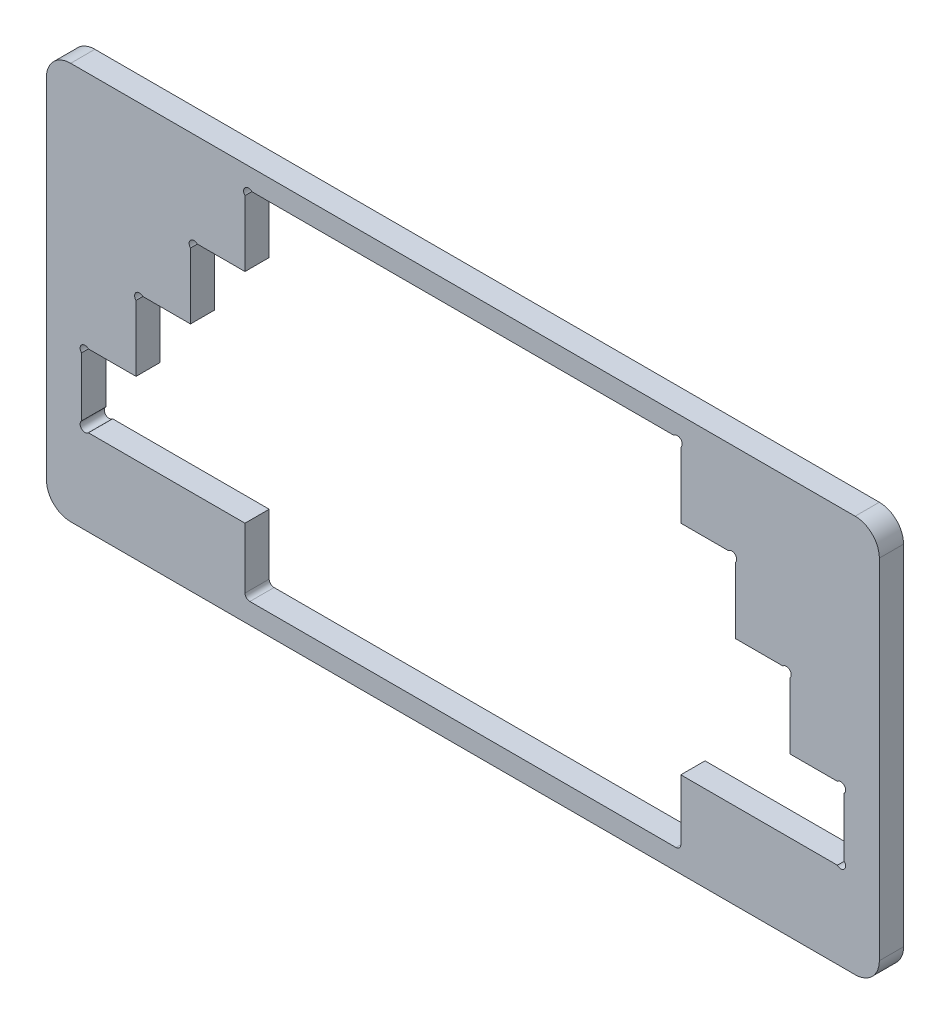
ISO-10303-21;
HEADER;
FILE_DESCRIPTION(('STEP AP214'),'2;1');
FILE_NAME('part.step','',(''),(''),'','','');
FILE_SCHEMA(('AUTOMOTIVE_DESIGN { 1 0 10303 214 1 1 1 1 }'));
ENDSEC;
DATA;
#1=APPLICATION_CONTEXT('core data for automotive mechanical design processes');
#2=APPLICATION_PROTOCOL_DEFINITION('international standard','automotive_design',2000,#1);
#3=PRODUCT_CONTEXT('',#1,'mechanical');
#4=PRODUCT('Part','Part','',(#3));
#5=PRODUCT_RELATED_PRODUCT_CATEGORY('part','',(#4));
#6=PRODUCT_DEFINITION_FORMATION('','',#4);
#7=PRODUCT_DEFINITION_CONTEXT('part definition',#1,'design');
#8=PRODUCT_DEFINITION('design','',#6,#7);
#9=PRODUCT_DEFINITION_SHAPE('','',#8);
#10=(LENGTH_UNIT() NAMED_UNIT(*) SI_UNIT(.MILLI.,.METRE.));
#11=(NAMED_UNIT(*) PLANE_ANGLE_UNIT() SI_UNIT($,.RADIAN.));
#12=(NAMED_UNIT(*) SI_UNIT($,.STERADIAN.) SOLID_ANGLE_UNIT());
#13=UNCERTAINTY_MEASURE_WITH_UNIT(LENGTH_MEASURE(1.E-05),#10,'distance_accuracy_value','');
#14=(GEOMETRIC_REPRESENTATION_CONTEXT(3) GLOBAL_UNCERTAINTY_ASSIGNED_CONTEXT((#13)) GLOBAL_UNIT_ASSIGNED_CONTEXT((#10,
#11,#12)) REPRESENTATION_CONTEXT('',''));
#15=CARTESIAN_POINT('',(0.,0.,0.));
#16=DIRECTION('',(0.,0.,1.));
#17=DIRECTION('',(1.,0.,0.));
#18=AXIS2_PLACEMENT_3D('',#15,#16,#17);
#19=CARTESIAN_POINT('',(162.,-25.5,10.));
#20=DIRECTION('',(0.,0.,-1.));
#21=DIRECTION('',(-1.,0.,0.));
#22=AXIS2_PLACEMENT_3D('',#19,#20,#21);
#23=PLANE('',#22);
#24=CARTESIAN_POINT('',(162.,-25.5,10.));
#25=DIRECTION('',(0.,0.,1.));
#26=DIRECTION('',(-1.,0.,0.));
#27=AXIS2_PLACEMENT_3D('',#24,#25,#26);
#28=CIRCLE('',#27,10.);
#29=CARTESIAN_POINT('',(162.,-35.5,10.));
#30=VERTEX_POINT('',#29);
#31=CARTESIAN_POINT('',(172.,-25.4999999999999,10.));
#32=VERTEX_POINT('',#31);
#33=EDGE_CURVE('E531',#30,#32,#28,.T.);
#34=ORIENTED_EDGE('',*,*,#33,.T.);
#35=DIRECTION('',(0.,1.,0.));
#36=VECTOR('',#35,1.);
#37=CARTESIAN_POINT('',(172.,118.5,10.));
#38=LINE('',#37,#36);
#39=CARTESIAN_POINT('',(172.,118.5,10.));
#40=VERTEX_POINT('',#39);
#41=EDGE_CURVE('E534',#32,#40,#38,.T.);
#42=ORIENTED_EDGE('',*,*,#41,.T.);
#43=CARTESIAN_POINT('',(162.,118.5,10.));
#44=DIRECTION('',(0.,0.,1.));
#45=DIRECTION('',(1.,0.,0.));
#46=AXIS2_PLACEMENT_3D('',#43,#44,#45);
#47=CIRCLE('',#46,10.);
#48=CARTESIAN_POINT('',(162.,128.5,10.));
#49=VERTEX_POINT('',#48);
#50=EDGE_CURVE('E536',#40,#49,#47,.T.);
#51=ORIENTED_EDGE('',*,*,#50,.T.);
#52=DIRECTION('',(-1.,0.,0.));
#53=VECTOR('',#52,1.);
#54=CARTESIAN_POINT('',(-162.,128.5,10.));
#55=LINE('',#54,#53);
#56=CARTESIAN_POINT('',(-162.,128.5,10.));
#57=VERTEX_POINT('',#56);
#58=EDGE_CURVE('E538',#49,#57,#55,.T.);
#59=ORIENTED_EDGE('',*,*,#58,.T.);
#60=CARTESIAN_POINT('',(-162.,118.5,10.));
#61=DIRECTION('',(0.,0.,1.));
#62=DIRECTION('',(-1.,0.,0.));
#63=AXIS2_PLACEMENT_3D('',#60,#61,#62);
#64=CIRCLE('',#63,10.);
#65=CARTESIAN_POINT('',(-172.,118.5,10.));
#66=VERTEX_POINT('',#65);
#67=EDGE_CURVE('E540',#57,#66,#64,.T.);
#68=ORIENTED_EDGE('',*,*,#67,.T.);
#69=DIRECTION('',(0.,-1.,0.));
#70=VECTOR('',#69,1.);
#71=CARTESIAN_POINT('',(-172.,118.5,10.));
#72=LINE('',#71,#70);
#73=CARTESIAN_POINT('',(-172.,-25.4999999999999,10.));
#74=VERTEX_POINT('',#73);
#75=EDGE_CURVE('E542',#66,#74,#72,.T.);
#76=ORIENTED_EDGE('',*,*,#75,.T.);
#77=CARTESIAN_POINT('',(-162.,-25.5,10.));
#78=DIRECTION('',(0.,0.,1.));
#79=DIRECTION('',(1.,0.,0.));
#80=AXIS2_PLACEMENT_3D('',#77,#78,#79);
#81=CIRCLE('',#80,10.);
#82=CARTESIAN_POINT('',(-162.,-35.5,10.));
#83=VERTEX_POINT('',#82);
#84=EDGE_CURVE('E544',#74,#83,#81,.T.);
#85=ORIENTED_EDGE('',*,*,#84,.T.);
#86=DIRECTION('',(1.,0.,0.));
#87=VECTOR('',#86,1.);
#88=CARTESIAN_POINT('',(162.,-35.5,10.));
#89=LINE('',#88,#87);
#90=EDGE_CURVE('E546',#83,#30,#89,.T.);
#91=ORIENTED_EDGE('',*,*,#90,.T.);
#92=EDGE_LOOP('',(#34,#42,#51,#59,#68,#76,#85,#91));
#93=FACE_BOUND('',#92,.T.);
#94=DIRECTION('',(0.,1.,0.));
#95=VECTOR('',#94,1.);
#96=CARTESIAN_POINT('',(90.,0.,10.));
#97=LINE('',#96,#95);
#98=CARTESIAN_POINT('',(90.0000000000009,-24.9999999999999,10.));
#99=VERTEX_POINT('',#98);
#100=CARTESIAN_POINT('',(90.,0.,10.));
#101=VERTEX_POINT('',#100);
#102=EDGE_CURVE('E298',#99,#101,#97,.T.);
#103=ORIENTED_EDGE('',*,*,#102,.F.);
#104=CARTESIAN_POINT('',(88.0000000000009,-25.,10.));
#105=DIRECTION('',(0.,0.,1.));
#106=DIRECTION('',(-1.,0.,0.));
#107=AXIS2_PLACEMENT_3D('',#104,#105,#106);
#108=CIRCLE('',#107,2.);
#109=CARTESIAN_POINT('',(88.0000000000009,-27.,10.));
#110=VERTEX_POINT('',#109);
#111=EDGE_CURVE('E453',#110,#99,#108,.T.);
#112=ORIENTED_EDGE('',*,*,#111,.F.);
#113=DIRECTION('',(1.,0.,0.));
#114=VECTOR('',#113,1.);
#115=CARTESIAN_POINT('',(-88.0000000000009,-27.,10.));
#116=LINE('',#115,#114);
#117=CARTESIAN_POINT('',(-88.0000000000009,-27.,10.));
#118=VERTEX_POINT('',#117);
#119=EDGE_CURVE('E451',#118,#110,#116,.T.);
#120=ORIENTED_EDGE('',*,*,#119,.F.);
#121=CARTESIAN_POINT('',(-88.0000000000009,-25.,10.));
#122=DIRECTION('',(0.,0.,1.));
#123=DIRECTION('',(1.,0.,0.));
#124=AXIS2_PLACEMENT_3D('',#121,#122,#123);
#125=CIRCLE('',#124,2.);
#126=CARTESIAN_POINT('',(-90.0000000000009,-24.9999999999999,10.));
#127=VERTEX_POINT('',#126);
#128=EDGE_CURVE('E449',#127,#118,#125,.T.);
#129=ORIENTED_EDGE('',*,*,#128,.F.);
#130=DIRECTION('',(0.,-1.,0.));
#131=VECTOR('',#130,1.);
#132=CARTESIAN_POINT('',(-90.,0.,10.));
#133=LINE('',#132,#131);
#134=CARTESIAN_POINT('',(-90.,0.,10.));
#135=VERTEX_POINT('',#134);
#136=EDGE_CURVE('E447',#135,#127,#133,.T.);
#137=ORIENTED_EDGE('',*,*,#136,.F.);
#138=DIRECTION('',(1.,0.,0.));
#139=VECTOR('',#138,1.);
#140=CARTESIAN_POINT('',(-154.671572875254,0.,10.));
#141=LINE('',#140,#139);
#142=CARTESIAN_POINT('',(-154.671572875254,0.,10.));
#143=VERTEX_POINT('',#142);
#144=EDGE_CURVE('E445',#143,#135,#141,.T.);
#145=ORIENTED_EDGE('',*,*,#144,.F.);
#146=CARTESIAN_POINT('',(-156.085786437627,1.41421356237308,10.));
#147=DIRECTION('',(0.,0.,1.));
#148=DIRECTION('',(-1.,0.,0.));
#149=AXIS2_PLACEMENT_3D('',#146,#147,#148);
#150=CIRCLE('',#149,2.00000000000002);
#151=CARTESIAN_POINT('',(-157.5,2.82842712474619,10.));
#152=VERTEX_POINT('',#151);
#153=EDGE_CURVE('E443',#152,#143,#150,.T.);
#154=ORIENTED_EDGE('',*,*,#153,.F.);
#155=DIRECTION('',(0.,-1.,0.));
#156=VECTOR('',#155,1.);
#157=CARTESIAN_POINT('',(-157.5,27.1715728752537,10.));
#158=LINE('',#157,#156);
#159=CARTESIAN_POINT('',(-157.5,27.1715728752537,10.));
#160=VERTEX_POINT('',#159);
#161=EDGE_CURVE('E441',#160,#152,#158,.T.);
#162=ORIENTED_EDGE('',*,*,#161,.F.);
#163=CARTESIAN_POINT('',(-156.085786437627,28.5857864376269,10.));
#164=DIRECTION('',(0.,0.,1.));
#165=DIRECTION('',(1.,0.,0.));
#166=AXIS2_PLACEMENT_3D('',#163,#164,#165);
#167=CIRCLE('',#166,2.);
#168=CARTESIAN_POINT('',(-154.671572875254,30.,10.));
#169=VERTEX_POINT('',#168);
#170=EDGE_CURVE('E439',#169,#160,#167,.T.);
#171=ORIENTED_EDGE('',*,*,#170,.F.);
#172=DIRECTION('',(-1.,0.,0.));
#173=VECTOR('',#172,1.);
#174=CARTESIAN_POINT('',(-135.,30.,10.));
#175=LINE('',#174,#173);
#176=CARTESIAN_POINT('',(-135.,30.,10.));
#177=VERTEX_POINT('',#176);
#178=EDGE_CURVE('E437',#177,#169,#175,.T.);
#179=ORIENTED_EDGE('',*,*,#178,.F.);
#180=DIRECTION('',(0.,-1.,0.));
#181=VECTOR('',#180,1.);
#182=CARTESIAN_POINT('',(-135.,57.1715728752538,10.));
#183=LINE('',#182,#181);
#184=CARTESIAN_POINT('',(-135.,57.1715728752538,10.));
#185=VERTEX_POINT('',#184);
#186=EDGE_CURVE('E435',#185,#177,#183,.T.);
#187=ORIENTED_EDGE('',*,*,#186,.F.);
#188=CARTESIAN_POINT('',(-133.585786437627,58.5857864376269,10.));
#189=DIRECTION('',(0.,0.,1.));
#190=DIRECTION('',(-1.,0.,0.));
#191=AXIS2_PLACEMENT_3D('',#188,#189,#190);
#192=CIRCLE('',#191,2.00000000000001);
#193=CARTESIAN_POINT('',(-132.171572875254,60.,10.));
#194=VERTEX_POINT('',#193);
#195=EDGE_CURVE('E433',#194,#185,#192,.T.);
#196=ORIENTED_EDGE('',*,*,#195,.F.);
#197=DIRECTION('',(-1.,0.,0.));
#198=VECTOR('',#197,1.);
#199=CARTESIAN_POINT('',(-112.5,60.,10.));
#200=LINE('',#199,#198);
#201=CARTESIAN_POINT('',(-112.5,60.,10.));
#202=VERTEX_POINT('',#201);
#203=EDGE_CURVE('E431',#202,#194,#200,.T.);
#204=ORIENTED_EDGE('',*,*,#203,.F.);
#205=DIRECTION('',(0.,-1.,0.));
#206=VECTOR('',#205,1.);
#207=CARTESIAN_POINT('',(-112.5,87.1715728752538,10.));
#208=LINE('',#207,#206);
#209=CARTESIAN_POINT('',(-112.5,87.1715728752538,10.));
#210=VERTEX_POINT('',#209);
#211=EDGE_CURVE('E429',#210,#202,#208,.T.);
#212=ORIENTED_EDGE('',*,*,#211,.F.);
#213=CARTESIAN_POINT('',(-111.085786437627,88.5857864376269,10.));
#214=DIRECTION('',(0.,0.,1.));
#215=DIRECTION('',(-1.,0.,0.));
#216=AXIS2_PLACEMENT_3D('',#213,#214,#215);
#217=CIRCLE('',#216,2.00000000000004);
#218=CARTESIAN_POINT('',(-109.671572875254,90.,10.));
#219=VERTEX_POINT('',#218);
#220=EDGE_CURVE('E427',#219,#210,#217,.T.);
#221=ORIENTED_EDGE('',*,*,#220,.F.);
#222=DIRECTION('',(-1.,0.,0.));
#223=VECTOR('',#222,1.);
#224=CARTESIAN_POINT('',(-90.0000000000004,90.,10.));
#225=LINE('',#224,#223);
#226=CARTESIAN_POINT('',(-90.0000000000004,90.,10.));
#227=VERTEX_POINT('',#226);
#228=EDGE_CURVE('E425',#227,#219,#225,.T.);
#229=ORIENTED_EDGE('',*,*,#228,.F.);
#230=DIRECTION('',(0.,-1.,0.));
#231=VECTOR('',#230,1.);
#232=CARTESIAN_POINT('',(-90.0000000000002,117.171572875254,10.));
#233=LINE('',#232,#231);
#234=CARTESIAN_POINT('',(-90.0000000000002,117.171572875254,10.));
#235=VERTEX_POINT('',#234);
#236=EDGE_CURVE('E423',#235,#227,#233,.T.);
#237=ORIENTED_EDGE('',*,*,#236,.F.);
#238=CARTESIAN_POINT('',(-88.5857864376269,118.585786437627,10.));
#239=DIRECTION('',(0.,0.,1.));
#240=DIRECTION('',(-1.,0.,0.));
#241=AXIS2_PLACEMENT_3D('',#238,#239,#240);
#242=CIRCLE('',#241,2.00000000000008);
#243=CARTESIAN_POINT('',(-87.1715728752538,120.,10.));
#244=VERTEX_POINT('',#243);
#245=EDGE_CURVE('E421',#244,#235,#242,.T.);
#246=ORIENTED_EDGE('',*,*,#245,.F.);
#247=DIRECTION('',(-1.,0.,0.));
#248=VECTOR('',#247,1.);
#249=CARTESIAN_POINT('',(-87.1715728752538,120.,10.));
#250=LINE('',#249,#248);
#251=CARTESIAN_POINT('',(87.1715728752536,120.,10.));
#252=VERTEX_POINT('',#251);
#253=EDGE_CURVE('E419',#252,#244,#250,.T.);
#254=ORIENTED_EDGE('',*,*,#253,.F.);
#255=CARTESIAN_POINT('',(88.5857864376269,118.585786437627,10.));
#256=DIRECTION('',(0.,0.,1.));
#257=DIRECTION('',(1.,0.,0.));
#258=AXIS2_PLACEMENT_3D('',#255,#256,#257);
#259=CIRCLE('',#258,2.00000000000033);
#260=CARTESIAN_POINT('',(90.000000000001,117.171572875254,10.));
#261=VERTEX_POINT('',#260);
#262=EDGE_CURVE('E417',#261,#252,#259,.T.);
#263=ORIENTED_EDGE('',*,*,#262,.F.);
#264=DIRECTION('',(0.,1.,0.));
#265=VECTOR('',#264,1.);
#266=CARTESIAN_POINT('',(90.000000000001,117.171572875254,10.));
#267=LINE('',#266,#265);
#268=CARTESIAN_POINT('',(90.0000000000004,90.,10.));
#269=VERTEX_POINT('',#268);
#270=EDGE_CURVE('E415',#269,#261,#267,.T.);
#271=ORIENTED_EDGE('',*,*,#270,.F.);
#272=DIRECTION('',(-1.,0.,0.));
#273=VECTOR('',#272,1.);
#274=CARTESIAN_POINT('',(90.0000000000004,90.,10.));
#275=LINE('',#274,#273);
#276=CARTESIAN_POINT('',(109.671572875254,90.0000000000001,10.));
#277=VERTEX_POINT('',#276);
#278=EDGE_CURVE('E413',#277,#269,#275,.T.);
#279=ORIENTED_EDGE('',*,*,#278,.F.);
#280=CARTESIAN_POINT('',(111.085786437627,88.5857864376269,10.));
#281=DIRECTION('',(0.,0.,1.));
#282=DIRECTION('',(1.,0.,0.));
#283=AXIS2_PLACEMENT_3D('',#280,#281,#282);
#284=CIRCLE('',#283,2.00000000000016);
#285=CARTESIAN_POINT('',(112.5,87.1715728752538,10.));
#286=VERTEX_POINT('',#285);
#287=EDGE_CURVE('E411',#286,#277,#284,.T.);
#288=ORIENTED_EDGE('',*,*,#287,.F.);
#289=DIRECTION('',(0.,1.,0.));
#290=VECTOR('',#289,1.);
#291=CARTESIAN_POINT('',(112.5,87.1715728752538,10.));
#292=LINE('',#291,#290);
#293=CARTESIAN_POINT('',(112.5,60.,10.));
#294=VERTEX_POINT('',#293);
#295=EDGE_CURVE('E409',#294,#286,#292,.T.);
#296=ORIENTED_EDGE('',*,*,#295,.F.);
#297=DIRECTION('',(-1.,0.,0.));
#298=VECTOR('',#297,1.);
#299=CARTESIAN_POINT('',(112.5,60.,10.));
#300=LINE('',#299,#298);
#301=CARTESIAN_POINT('',(132.171572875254,60.,10.));
#302=VERTEX_POINT('',#301);
#303=EDGE_CURVE('E407',#302,#294,#300,.T.);
#304=ORIENTED_EDGE('',*,*,#303,.F.);
#305=CARTESIAN_POINT('',(133.585786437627,58.5857864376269,10.));
#306=DIRECTION('',(0.,0.,1.));
#307=DIRECTION('',(1.,0.,0.));
#308=AXIS2_PLACEMENT_3D('',#305,#306,#307);
#309=CIRCLE('',#308,2.00000000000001);
#310=CARTESIAN_POINT('',(135.,57.1715728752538,10.));
#311=VERTEX_POINT('',#310);
#312=EDGE_CURVE('E405',#311,#302,#309,.T.);
#313=ORIENTED_EDGE('',*,*,#312,.F.);
#314=DIRECTION('',(0.,1.,0.));
#315=VECTOR('',#314,1.);
#316=CARTESIAN_POINT('',(135.,57.1715728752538,10.));
#317=LINE('',#316,#315);
#318=CARTESIAN_POINT('',(135.,30.,10.));
#319=VERTEX_POINT('',#318);
#320=EDGE_CURVE('E403',#319,#311,#317,.T.);
#321=ORIENTED_EDGE('',*,*,#320,.F.);
#322=DIRECTION('',(-1.,0.,0.));
#323=VECTOR('',#322,1.);
#324=CARTESIAN_POINT('',(135.,30.,10.));
#325=LINE('',#324,#323);
#326=CARTESIAN_POINT('',(154.671572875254,30.,10.));
#327=VERTEX_POINT('',#326);
#328=EDGE_CURVE('E401',#327,#319,#325,.T.);
#329=ORIENTED_EDGE('',*,*,#328,.F.);
#330=CARTESIAN_POINT('',(156.085786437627,28.5857864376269,10.));
#331=DIRECTION('',(0.,0.,1.));
#332=DIRECTION('',(-1.,0.,0.));
#333=AXIS2_PLACEMENT_3D('',#330,#331,#332);
#334=CIRCLE('',#333,2.);
#335=CARTESIAN_POINT('',(157.5,27.1715728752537,10.));
#336=VERTEX_POINT('',#335);
#337=EDGE_CURVE('E399',#336,#327,#334,.T.);
#338=ORIENTED_EDGE('',*,*,#337,.F.);
#339=DIRECTION('',(0.,1.,0.));
#340=VECTOR('',#339,1.);
#341=CARTESIAN_POINT('',(157.5,27.1715728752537,10.));
#342=LINE('',#341,#340);
#343=CARTESIAN_POINT('',(157.5,2.82842712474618,10.));
#344=VERTEX_POINT('',#343);
#345=EDGE_CURVE('E397',#344,#336,#342,.T.);
#346=ORIENTED_EDGE('',*,*,#345,.F.);
#347=CARTESIAN_POINT('',(156.085786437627,1.41421356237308,10.));
#348=DIRECTION('',(0.,0.,1.));
#349=DIRECTION('',(1.,0.,0.));
#350=AXIS2_PLACEMENT_3D('',#347,#348,#349);
#351=CIRCLE('',#350,2.00000000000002);
#352=CARTESIAN_POINT('',(154.671572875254,0.,10.));
#353=VERTEX_POINT('',#352);
#354=EDGE_CURVE('E395',#353,#344,#351,.T.);
#355=ORIENTED_EDGE('',*,*,#354,.F.);
#356=DIRECTION('',(1.,0.,0.));
#357=VECTOR('',#356,1.);
#358=CARTESIAN_POINT('',(154.671572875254,0.,10.));
#359=LINE('',#358,#357);
#360=EDGE_CURVE('E393',#101,#353,#359,.T.);
#361=ORIENTED_EDGE('',*,*,#360,.F.);
#362=EDGE_LOOP('',(#103,#112,#120,#129,#137,#145,#154,#162,#171,#179,#187,#196,#204,#212,#221,
#229,#237,#246,#254,#263,#271,#279,#288,#296,#304,#313,#321,#329,#338,#346,#355,#361));
#363=FACE_BOUND('',#362,.T.);
#364=ADVANCED_FACE('F26',(#93,#363),#23,.F.);
#365=CARTESIAN_POINT('',(162.,-25.5,0.));
#366=DIRECTION('',(0.,0.,-1.));
#367=DIRECTION('',(-1.,0.,0.));
#368=AXIS2_PLACEMENT_3D('',#365,#366,#367);
#369=PLANE('',#368);
#370=CARTESIAN_POINT('',(162.,-25.5,0.));
#371=DIRECTION('',(0.,0.,1.));
#372=DIRECTION('',(-1.,0.,0.));
#373=AXIS2_PLACEMENT_3D('',#370,#371,#372);
#374=CIRCLE('',#373,10.);
#375=CARTESIAN_POINT('',(162.,-35.5,0.));
#376=VERTEX_POINT('',#375);
#377=CARTESIAN_POINT('',(172.,-25.4999999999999,0.));
#378=VERTEX_POINT('',#377);
#379=EDGE_CURVE('E299',#376,#378,#374,.T.);
#380=ORIENTED_EDGE('',*,*,#379,.F.);
#381=DIRECTION('',(1.,0.,0.));
#382=VECTOR('',#381,1.);
#383=CARTESIAN_POINT('',(162.,-35.5,0.));
#384=LINE('',#383,#382);
#385=CARTESIAN_POINT('',(-162.,-35.5,0.));
#386=VERTEX_POINT('',#385);
#387=EDGE_CURVE('E529',#386,#376,#384,.T.);
#388=ORIENTED_EDGE('',*,*,#387,.F.);
#389=CARTESIAN_POINT('',(-162.,-25.5,0.));
#390=DIRECTION('',(0.,0.,1.));
#391=DIRECTION('',(1.,0.,0.));
#392=AXIS2_PLACEMENT_3D('',#389,#390,#391);
#393=CIRCLE('',#392,10.);
#394=CARTESIAN_POINT('',(-172.,-25.4999999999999,0.));
#395=VERTEX_POINT('',#394);
#396=EDGE_CURVE('E527',#395,#386,#393,.T.);
#397=ORIENTED_EDGE('',*,*,#396,.F.);
#398=DIRECTION('',(0.,-1.,0.));
#399=VECTOR('',#398,1.);
#400=CARTESIAN_POINT('',(-172.,118.5,0.));
#401=LINE('',#400,#399);
#402=CARTESIAN_POINT('',(-172.,118.5,0.));
#403=VERTEX_POINT('',#402);
#404=EDGE_CURVE('E525',#403,#395,#401,.T.);
#405=ORIENTED_EDGE('',*,*,#404,.F.);
#406=CARTESIAN_POINT('',(-162.,118.5,0.));
#407=DIRECTION('',(0.,0.,1.));
#408=DIRECTION('',(-1.,0.,0.));
#409=AXIS2_PLACEMENT_3D('',#406,#407,#408);
#410=CIRCLE('',#409,10.);
#411=CARTESIAN_POINT('',(-162.,128.5,0.));
#412=VERTEX_POINT('',#411);
#413=EDGE_CURVE('E523',#412,#403,#410,.T.);
#414=ORIENTED_EDGE('',*,*,#413,.F.);
#415=DIRECTION('',(-1.,0.,0.));
#416=VECTOR('',#415,1.);
#417=CARTESIAN_POINT('',(-162.,128.5,0.));
#418=LINE('',#417,#416);
#419=CARTESIAN_POINT('',(162.,128.5,0.));
#420=VERTEX_POINT('',#419);
#421=EDGE_CURVE('E521',#420,#412,#418,.T.);
#422=ORIENTED_EDGE('',*,*,#421,.F.);
#423=CARTESIAN_POINT('',(162.,118.5,0.));
#424=DIRECTION('',(0.,0.,1.));
#425=DIRECTION('',(1.,0.,0.));
#426=AXIS2_PLACEMENT_3D('',#423,#424,#425);
#427=CIRCLE('',#426,10.);
#428=CARTESIAN_POINT('',(172.,118.5,0.));
#429=VERTEX_POINT('',#428);
#430=EDGE_CURVE('E519',#429,#420,#427,.T.);
#431=ORIENTED_EDGE('',*,*,#430,.F.);
#432=DIRECTION('',(0.,1.,0.));
#433=VECTOR('',#432,1.);
#434=CARTESIAN_POINT('',(172.,118.5,0.));
#435=LINE('',#434,#433);
#436=EDGE_CURVE('E517',#378,#429,#435,.T.);
#437=ORIENTED_EDGE('',*,*,#436,.F.);
#438=EDGE_LOOP('',(#380,#388,#397,#405,#414,#422,#431,#437));
#439=FACE_BOUND('',#438,.T.);
#440=CARTESIAN_POINT('',(88.0000000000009,-25.,0.));
#441=DIRECTION('',(0.,0.,1.));
#442=DIRECTION('',(-1.,0.,0.));
#443=AXIS2_PLACEMENT_3D('',#440,#441,#442);
#444=CIRCLE('',#443,2.);
#445=CARTESIAN_POINT('',(88.0000000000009,-27.,0.));
#446=VERTEX_POINT('',#445);
#447=CARTESIAN_POINT('',(90.0000000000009,-24.9999999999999,0.));
#448=VERTEX_POINT('',#447);
#449=EDGE_CURVE('E304',#446,#448,#444,.T.);
#450=ORIENTED_EDGE('',*,*,#449,.T.);
#451=DIRECTION('',(0.,1.,0.));
#452=VECTOR('',#451,1.);
#453=CARTESIAN_POINT('',(90.,0.,0.));
#454=LINE('',#453,#452);
#455=CARTESIAN_POINT('',(90.,0.,0.));
#456=VERTEX_POINT('',#455);
#457=EDGE_CURVE('E49',#448,#456,#454,.T.);
#458=ORIENTED_EDGE('',*,*,#457,.T.);
#459=DIRECTION('',(1.,0.,0.));
#460=VECTOR('',#459,1.);
#461=CARTESIAN_POINT('',(154.671572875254,0.,0.));
#462=LINE('',#461,#460);
#463=CARTESIAN_POINT('',(154.671572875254,0.,0.));
#464=VERTEX_POINT('',#463);
#465=EDGE_CURVE('E285',#456,#464,#462,.T.);
#466=ORIENTED_EDGE('',*,*,#465,.T.);
#467=CARTESIAN_POINT('',(156.085786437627,1.41421356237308,0.));
#468=DIRECTION('',(0.,0.,1.));
#469=DIRECTION('',(1.,0.,0.));
#470=AXIS2_PLACEMENT_3D('',#467,#468,#469);
#471=CIRCLE('',#470,2.00000000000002);
#472=CARTESIAN_POINT('',(157.5,2.82842712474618,0.));
#473=VERTEX_POINT('',#472);
#474=EDGE_CURVE('E294',#464,#473,#471,.T.);
#475=ORIENTED_EDGE('',*,*,#474,.T.);
#476=DIRECTION('',(0.,1.,0.));
#477=VECTOR('',#476,1.);
#478=CARTESIAN_POINT('',(157.5,27.1715728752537,0.));
#479=LINE('',#478,#477);
#480=CARTESIAN_POINT('',(157.5,27.1715728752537,0.));
#481=VERTEX_POINT('',#480);
#482=EDGE_CURVE('E308',#473,#481,#479,.T.);
#483=ORIENTED_EDGE('',*,*,#482,.T.);
#484=CARTESIAN_POINT('',(156.085786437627,28.5857864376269,0.));
#485=DIRECTION('',(0.,0.,1.));
#486=DIRECTION('',(-1.,0.,0.));
#487=AXIS2_PLACEMENT_3D('',#484,#485,#486);
#488=CIRCLE('',#487,2.);
#489=CARTESIAN_POINT('',(154.671572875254,30.,0.));
#490=VERTEX_POINT('',#489);
#491=EDGE_CURVE('E311',#481,#490,#488,.T.);
#492=ORIENTED_EDGE('',*,*,#491,.T.);
#493=DIRECTION('',(-1.,0.,0.));
#494=VECTOR('',#493,1.);
#495=CARTESIAN_POINT('',(135.,30.,0.));
#496=LINE('',#495,#494);
#497=CARTESIAN_POINT('',(135.,30.,0.));
#498=VERTEX_POINT('',#497);
#499=EDGE_CURVE('E314',#490,#498,#496,.T.);
#500=ORIENTED_EDGE('',*,*,#499,.T.);
#501=DIRECTION('',(0.,1.,0.));
#502=VECTOR('',#501,1.);
#503=CARTESIAN_POINT('',(135.,57.1715728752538,0.));
#504=LINE('',#503,#502);
#505=CARTESIAN_POINT('',(135.,57.1715728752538,0.));
#506=VERTEX_POINT('',#505);
#507=EDGE_CURVE('E317',#498,#506,#504,.T.);
#508=ORIENTED_EDGE('',*,*,#507,.T.);
#509=CARTESIAN_POINT('',(133.585786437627,58.5857864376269,0.));
#510=DIRECTION('',(0.,0.,1.));
#511=DIRECTION('',(1.,0.,0.));
#512=AXIS2_PLACEMENT_3D('',#509,#510,#511);
#513=CIRCLE('',#512,2.00000000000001);
#514=CARTESIAN_POINT('',(132.171572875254,60.,0.));
#515=VERTEX_POINT('',#514);
#516=EDGE_CURVE('E320',#506,#515,#513,.T.);
#517=ORIENTED_EDGE('',*,*,#516,.T.);
#518=DIRECTION('',(-1.,0.,0.));
#519=VECTOR('',#518,1.);
#520=CARTESIAN_POINT('',(112.5,60.,0.));
#521=LINE('',#520,#519);
#522=CARTESIAN_POINT('',(112.5,60.,0.));
#523=VERTEX_POINT('',#522);
#524=EDGE_CURVE('E323',#515,#523,#521,.T.);
#525=ORIENTED_EDGE('',*,*,#524,.T.);
#526=DIRECTION('',(0.,1.,0.));
#527=VECTOR('',#526,1.);
#528=CARTESIAN_POINT('',(112.5,87.1715728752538,0.));
#529=LINE('',#528,#527);
#530=CARTESIAN_POINT('',(112.5,87.1715728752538,0.));
#531=VERTEX_POINT('',#530);
#532=EDGE_CURVE('E326',#523,#531,#529,.T.);
#533=ORIENTED_EDGE('',*,*,#532,.T.);
#534=CARTESIAN_POINT('',(111.085786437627,88.5857864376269,0.));
#535=DIRECTION('',(0.,0.,1.));
#536=DIRECTION('',(1.,0.,0.));
#537=AXIS2_PLACEMENT_3D('',#534,#535,#536);
#538=CIRCLE('',#537,2.00000000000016);
#539=CARTESIAN_POINT('',(109.671572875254,90.0000000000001,0.));
#540=VERTEX_POINT('',#539);
#541=EDGE_CURVE('E329',#531,#540,#538,.T.);
#542=ORIENTED_EDGE('',*,*,#541,.T.);
#543=DIRECTION('',(-1.,0.,0.));
#544=VECTOR('',#543,1.);
#545=CARTESIAN_POINT('',(90.0000000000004,90.,0.));
#546=LINE('',#545,#544);
#547=CARTESIAN_POINT('',(90.0000000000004,90.,0.));
#548=VERTEX_POINT('',#547);
#549=EDGE_CURVE('E332',#540,#548,#546,.T.);
#550=ORIENTED_EDGE('',*,*,#549,.T.);
#551=DIRECTION('',(0.,1.,0.));
#552=VECTOR('',#551,1.);
#553=CARTESIAN_POINT('',(90.000000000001,117.171572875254,0.));
#554=LINE('',#553,#552);
#555=CARTESIAN_POINT('',(90.000000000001,117.171572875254,0.));
#556=VERTEX_POINT('',#555);
#557=EDGE_CURVE('E335',#548,#556,#554,.T.);
#558=ORIENTED_EDGE('',*,*,#557,.T.);
#559=CARTESIAN_POINT('',(88.5857864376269,118.585786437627,0.));
#560=DIRECTION('',(0.,0.,1.));
#561=DIRECTION('',(1.,0.,0.));
#562=AXIS2_PLACEMENT_3D('',#559,#560,#561);
#563=CIRCLE('',#562,2.00000000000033);
#564=CARTESIAN_POINT('',(87.1715728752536,120.,0.));
#565=VERTEX_POINT('',#564);
#566=EDGE_CURVE('E338',#556,#565,#563,.T.);
#567=ORIENTED_EDGE('',*,*,#566,.T.);
#568=DIRECTION('',(-1.,0.,0.));
#569=VECTOR('',#568,1.);
#570=CARTESIAN_POINT('',(-87.1715728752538,120.,0.));
#571=LINE('',#570,#569);
#572=CARTESIAN_POINT('',(-87.1715728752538,120.,0.));
#573=VERTEX_POINT('',#572);
#574=EDGE_CURVE('E341',#565,#573,#571,.T.);
#575=ORIENTED_EDGE('',*,*,#574,.T.);
#576=CARTESIAN_POINT('',(-88.5857864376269,118.585786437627,0.));
#577=DIRECTION('',(0.,0.,1.));
#578=DIRECTION('',(-1.,0.,0.));
#579=AXIS2_PLACEMENT_3D('',#576,#577,#578);
#580=CIRCLE('',#579,2.00000000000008);
#581=CARTESIAN_POINT('',(-90.0000000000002,117.171572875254,0.));
#582=VERTEX_POINT('',#581);
#583=EDGE_CURVE('E344',#573,#582,#580,.T.);
#584=ORIENTED_EDGE('',*,*,#583,.T.);
#585=DIRECTION('',(0.,-1.,0.));
#586=VECTOR('',#585,1.);
#587=CARTESIAN_POINT('',(-90.0000000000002,117.171572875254,0.));
#588=LINE('',#587,#586);
#589=CARTESIAN_POINT('',(-90.0000000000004,90.,0.));
#590=VERTEX_POINT('',#589);
#591=EDGE_CURVE('E347',#582,#590,#588,.T.);
#592=ORIENTED_EDGE('',*,*,#591,.T.);
#593=DIRECTION('',(-1.,0.,0.));
#594=VECTOR('',#593,1.);
#595=CARTESIAN_POINT('',(-90.0000000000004,90.,0.));
#596=LINE('',#595,#594);
#597=CARTESIAN_POINT('',(-109.671572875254,90.,0.));
#598=VERTEX_POINT('',#597);
#599=EDGE_CURVE('E350',#590,#598,#596,.T.);
#600=ORIENTED_EDGE('',*,*,#599,.T.);
#601=CARTESIAN_POINT('',(-111.085786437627,88.5857864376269,0.));
#602=DIRECTION('',(0.,0.,1.));
#603=DIRECTION('',(-1.,0.,0.));
#604=AXIS2_PLACEMENT_3D('',#601,#602,#603);
#605=CIRCLE('',#604,2.00000000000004);
#606=CARTESIAN_POINT('',(-112.5,87.1715728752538,0.));
#607=VERTEX_POINT('',#606);
#608=EDGE_CURVE('E353',#598,#607,#605,.T.);
#609=ORIENTED_EDGE('',*,*,#608,.T.);
#610=DIRECTION('',(0.,-1.,0.));
#611=VECTOR('',#610,1.);
#612=CARTESIAN_POINT('',(-112.5,87.1715728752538,0.));
#613=LINE('',#612,#611);
#614=CARTESIAN_POINT('',(-112.5,60.,0.));
#615=VERTEX_POINT('',#614);
#616=EDGE_CURVE('E356',#607,#615,#613,.T.);
#617=ORIENTED_EDGE('',*,*,#616,.T.);
#618=DIRECTION('',(-1.,0.,0.));
#619=VECTOR('',#618,1.);
#620=CARTESIAN_POINT('',(-112.5,60.,0.));
#621=LINE('',#620,#619);
#622=CARTESIAN_POINT('',(-132.171572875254,60.,0.));
#623=VERTEX_POINT('',#622);
#624=EDGE_CURVE('E359',#615,#623,#621,.T.);
#625=ORIENTED_EDGE('',*,*,#624,.T.);
#626=CARTESIAN_POINT('',(-133.585786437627,58.5857864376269,0.));
#627=DIRECTION('',(0.,0.,1.));
#628=DIRECTION('',(-1.,0.,0.));
#629=AXIS2_PLACEMENT_3D('',#626,#627,#628);
#630=CIRCLE('',#629,2.00000000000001);
#631=CARTESIAN_POINT('',(-135.,57.1715728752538,0.));
#632=VERTEX_POINT('',#631);
#633=EDGE_CURVE('E362',#623,#632,#630,.T.);
#634=ORIENTED_EDGE('',*,*,#633,.T.);
#635=DIRECTION('',(0.,-1.,0.));
#636=VECTOR('',#635,1.);
#637=CARTESIAN_POINT('',(-135.,57.1715728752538,0.));
#638=LINE('',#637,#636);
#639=CARTESIAN_POINT('',(-135.,30.,0.));
#640=VERTEX_POINT('',#639);
#641=EDGE_CURVE('E365',#632,#640,#638,.T.);
#642=ORIENTED_EDGE('',*,*,#641,.T.);
#643=DIRECTION('',(-1.,0.,0.));
#644=VECTOR('',#643,1.);
#645=CARTESIAN_POINT('',(-135.,30.,0.));
#646=LINE('',#645,#644);
#647=CARTESIAN_POINT('',(-154.671572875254,30.,0.));
#648=VERTEX_POINT('',#647);
#649=EDGE_CURVE('E368',#640,#648,#646,.T.);
#650=ORIENTED_EDGE('',*,*,#649,.T.);
#651=CARTESIAN_POINT('',(-156.085786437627,28.5857864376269,0.));
#652=DIRECTION('',(0.,0.,1.));
#653=DIRECTION('',(1.,0.,0.));
#654=AXIS2_PLACEMENT_3D('',#651,#652,#653);
#655=CIRCLE('',#654,2.);
#656=CARTESIAN_POINT('',(-157.5,27.1715728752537,0.));
#657=VERTEX_POINT('',#656);
#658=EDGE_CURVE('E371',#648,#657,#655,.T.);
#659=ORIENTED_EDGE('',*,*,#658,.T.);
#660=DIRECTION('',(0.,-1.,0.));
#661=VECTOR('',#660,1.);
#662=CARTESIAN_POINT('',(-157.5,27.1715728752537,0.));
#663=LINE('',#662,#661);
#664=CARTESIAN_POINT('',(-157.5,2.82842712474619,0.));
#665=VERTEX_POINT('',#664);
#666=EDGE_CURVE('E374',#657,#665,#663,.T.);
#667=ORIENTED_EDGE('',*,*,#666,.T.);
#668=CARTESIAN_POINT('',(-156.085786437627,1.41421356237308,0.));
#669=DIRECTION('',(0.,0.,1.));
#670=DIRECTION('',(-1.,0.,0.));
#671=AXIS2_PLACEMENT_3D('',#668,#669,#670);
#672=CIRCLE('',#671,2.00000000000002);
#673=CARTESIAN_POINT('',(-154.671572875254,0.,0.));
#674=VERTEX_POINT('',#673);
#675=EDGE_CURVE('E377',#665,#674,#672,.T.);
#676=ORIENTED_EDGE('',*,*,#675,.T.);
#677=DIRECTION('',(1.,0.,0.));
#678=VECTOR('',#677,1.);
#679=CARTESIAN_POINT('',(-154.671572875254,0.,0.));
#680=LINE('',#679,#678);
#681=CARTESIAN_POINT('',(-90.,0.,0.));
#682=VERTEX_POINT('',#681);
#683=EDGE_CURVE('E380',#674,#682,#680,.T.);
#684=ORIENTED_EDGE('',*,*,#683,.T.);
#685=DIRECTION('',(0.,-1.,0.));
#686=VECTOR('',#685,1.);
#687=CARTESIAN_POINT('',(-90.,0.,0.));
#688=LINE('',#687,#686);
#689=CARTESIAN_POINT('',(-90.0000000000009,-24.9999999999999,0.));
#690=VERTEX_POINT('',#689);
#691=EDGE_CURVE('E383',#682,#690,#688,.T.);
#692=ORIENTED_EDGE('',*,*,#691,.T.);
#693=CARTESIAN_POINT('',(-88.0000000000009,-25.,0.));
#694=DIRECTION('',(0.,0.,1.));
#695=DIRECTION('',(1.,0.,0.));
#696=AXIS2_PLACEMENT_3D('',#693,#694,#695);
#697=CIRCLE('',#696,2.);
#698=CARTESIAN_POINT('',(-88.0000000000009,-27.,0.));
#699=VERTEX_POINT('',#698);
#700=EDGE_CURVE('E386',#690,#699,#697,.T.);
#701=ORIENTED_EDGE('',*,*,#700,.T.);
#702=DIRECTION('',(1.,0.,0.));
#703=VECTOR('',#702,1.);
#704=CARTESIAN_POINT('',(-88.0000000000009,-27.,0.));
#705=LINE('',#704,#703);
#706=EDGE_CURVE('E389',#699,#446,#705,.T.);
#707=ORIENTED_EDGE('',*,*,#706,.T.);
#708=EDGE_LOOP('',(#450,#458,#466,#475,#483,#492,#500,#508,#517,#525,#533,#542,#550,#558,#567,
#575,#584,#592,#600,#609,#617,#625,#634,#642,#650,#659,#667,#676,#684,#692,#701,#707));
#709=FACE_BOUND('',#708,.T.);
#710=ADVANCED_FACE('F302',(#439,#709),#369,.T.);
#711=CARTESIAN_POINT('',(162.,-25.5,10.));
#712=DIRECTION('',(0.,0.,-1.));
#713=DIRECTION('',(-1.,0.,0.));
#714=AXIS2_PLACEMENT_3D('',#711,#712,#713);
#715=CYLINDRICAL_SURFACE('',#714,10.);
#716=ORIENTED_EDGE('',*,*,#379,.T.);
#717=DIRECTION('',(0.,0.,-1.));
#718=VECTOR('',#717,1.);
#719=CARTESIAN_POINT('',(172.,-25.4999999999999,10.));
#720=LINE('',#719,#718);
#721=EDGE_CURVE('E11',#32,#378,#720,.T.);
#722=ORIENTED_EDGE('',*,*,#721,.F.);
#723=ORIENTED_EDGE('',*,*,#33,.F.);
#724=DIRECTION('',(0.,0.,-1.));
#725=VECTOR('',#724,1.);
#726=CARTESIAN_POINT('',(162.,-35.5,10.));
#727=LINE('',#726,#725);
#728=EDGE_CURVE('E548',#30,#376,#727,.T.);
#729=ORIENTED_EDGE('',*,*,#728,.T.);
#730=EDGE_LOOP('',(#716,#722,#723,#729));
#731=FACE_BOUND('',#730,.T.);
#732=ADVANCED_FACE('F28',(#731),#715,.T.);
#733=CARTESIAN_POINT('',(172.,118.5,10.));
#734=DIRECTION('',(-1.,0.,0.));
#735=DIRECTION('',(0.,-1.,0.));
#736=AXIS2_PLACEMENT_3D('',#733,#734,#735);
#737=PLANE('',#736);
#738=ORIENTED_EDGE('',*,*,#436,.T.);
#739=DIRECTION('',(0.,0.,-1.));
#740=VECTOR('',#739,1.);
#741=CARTESIAN_POINT('',(172.,118.5,10.));
#742=LINE('',#741,#740);
#743=EDGE_CURVE('E34',#40,#429,#742,.T.);
#744=ORIENTED_EDGE('',*,*,#743,.F.);
#745=ORIENTED_EDGE('',*,*,#41,.F.);
#746=ORIENTED_EDGE('',*,*,#721,.T.);
#747=EDGE_LOOP('',(#738,#744,#745,#746));
#748=FACE_BOUND('',#747,.T.);
#749=ADVANCED_FACE('F592',(#748),#737,.F.);
#750=CARTESIAN_POINT('',(162.,118.5,10.));
#751=DIRECTION('',(0.,0.,-1.));
#752=DIRECTION('',(-1.,0.,0.));
#753=AXIS2_PLACEMENT_3D('',#750,#751,#752);
#754=CYLINDRICAL_SURFACE('',#753,10.);
#755=ORIENTED_EDGE('',*,*,#430,.T.);
#756=DIRECTION('',(0.,0.,-1.));
#757=VECTOR('',#756,1.);
#758=CARTESIAN_POINT('',(162.,128.5,10.));
#759=LINE('',#758,#757);
#760=EDGE_CURVE('E563',#49,#420,#759,.T.);
#761=ORIENTED_EDGE('',*,*,#760,.F.);
#762=ORIENTED_EDGE('',*,*,#50,.F.);
#763=ORIENTED_EDGE('',*,*,#743,.T.);
#764=EDGE_LOOP('',(#755,#761,#762,#763));
#765=FACE_BOUND('',#764,.T.);
#766=ADVANCED_FACE('F570',(#765),#754,.T.);
#767=CARTESIAN_POINT('',(-162.,128.5,10.));
#768=DIRECTION('',(0.,-1.,0.));
#769=DIRECTION('',(0.,0.,-1.));
#770=AXIS2_PLACEMENT_3D('',#767,#768,#769);
#771=PLANE('',#770);
#772=ORIENTED_EDGE('',*,*,#421,.T.);
#773=DIRECTION('',(0.,0.,-1.));
#774=VECTOR('',#773,1.);
#775=CARTESIAN_POINT('',(-162.,128.5,10.));
#776=LINE('',#775,#774);
#777=EDGE_CURVE('E560',#57,#412,#776,.T.);
#778=ORIENTED_EDGE('',*,*,#777,.F.);
#779=ORIENTED_EDGE('',*,*,#58,.F.);
#780=ORIENTED_EDGE('',*,*,#760,.T.);
#781=EDGE_LOOP('',(#772,#778,#779,#780));
#782=FACE_BOUND('',#781,.T.);
#783=ADVANCED_FACE('F580',(#782),#771,.F.);
#784=CARTESIAN_POINT('',(-162.,118.5,10.));
#785=DIRECTION('',(0.,0.,-1.));
#786=DIRECTION('',(-1.,0.,0.));
#787=AXIS2_PLACEMENT_3D('',#784,#785,#786);
#788=CYLINDRICAL_SURFACE('',#787,10.);
#789=ORIENTED_EDGE('',*,*,#413,.T.);
#790=DIRECTION('',(0.,0.,-1.));
#791=VECTOR('',#790,1.);
#792=CARTESIAN_POINT('',(-172.,118.5,10.));
#793=LINE('',#792,#791);
#794=EDGE_CURVE('E557',#66,#403,#793,.T.);
#795=ORIENTED_EDGE('',*,*,#794,.F.);
#796=ORIENTED_EDGE('',*,*,#67,.F.);
#797=ORIENTED_EDGE('',*,*,#777,.T.);
#798=EDGE_LOOP('',(#789,#795,#796,#797));
#799=FACE_BOUND('',#798,.T.);
#800=ADVANCED_FACE('F584',(#799),#788,.T.);
#801=CARTESIAN_POINT('',(-172.,118.5,10.));
#802=DIRECTION('',(1.,0.,0.));
#803=DIRECTION('',(0.,1.,0.));
#804=AXIS2_PLACEMENT_3D('',#801,#802,#803);
#805=PLANE('',#804);
#806=ORIENTED_EDGE('',*,*,#404,.T.);
#807=DIRECTION('',(0.,0.,-1.));
#808=VECTOR('',#807,1.);
#809=CARTESIAN_POINT('',(-172.,-25.4999999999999,10.));
#810=LINE('',#809,#808);
#811=EDGE_CURVE('E554',#74,#395,#810,.T.);
#812=ORIENTED_EDGE('',*,*,#811,.F.);
#813=ORIENTED_EDGE('',*,*,#75,.F.);
#814=ORIENTED_EDGE('',*,*,#794,.T.);
#815=EDGE_LOOP('',(#806,#812,#813,#814));
#816=FACE_BOUND('',#815,.T.);
#817=ADVANCED_FACE('F605',(#816),#805,.F.);
#818=CARTESIAN_POINT('',(-162.,-25.5,10.));
#819=DIRECTION('',(0.,0.,-1.));
#820=DIRECTION('',(-1.,0.,0.));
#821=AXIS2_PLACEMENT_3D('',#818,#819,#820);
#822=CYLINDRICAL_SURFACE('',#821,10.);
#823=ORIENTED_EDGE('',*,*,#396,.T.);
#824=DIRECTION('',(0.,0.,-1.));
#825=VECTOR('',#824,1.);
#826=CARTESIAN_POINT('',(-162.,-35.5,10.));
#827=LINE('',#826,#825);
#828=EDGE_CURVE('E551',#83,#386,#827,.T.);
#829=ORIENTED_EDGE('',*,*,#828,.F.);
#830=ORIENTED_EDGE('',*,*,#84,.F.);
#831=ORIENTED_EDGE('',*,*,#811,.T.);
#832=EDGE_LOOP('',(#823,#829,#830,#831));
#833=FACE_BOUND('',#832,.T.);
#834=ADVANCED_FACE('F603',(#833),#822,.T.);
#835=CARTESIAN_POINT('',(162.,-35.5,10.));
#836=DIRECTION('',(0.,1.,0.));
#837=DIRECTION('',(0.,0.,1.));
#838=AXIS2_PLACEMENT_3D('',#835,#836,#837);
#839=PLANE('',#838);
#840=ORIENTED_EDGE('',*,*,#387,.T.);
#841=ORIENTED_EDGE('',*,*,#728,.F.);
#842=ORIENTED_EDGE('',*,*,#90,.F.);
#843=ORIENTED_EDGE('',*,*,#828,.T.);
#844=EDGE_LOOP('',(#840,#841,#842,#843));
#845=FACE_BOUND('',#844,.T.);
#846=ADVANCED_FACE('F598',(#845),#839,.F.);
#847=CARTESIAN_POINT('',(90.,0.,10.));
#848=DIRECTION('',(-1.,0.,0.));
#849=DIRECTION('',(0.,-1.,0.));
#850=AXIS2_PLACEMENT_3D('',#847,#848,#849);
#851=PLANE('',#850);
#852=ORIENTED_EDGE('',*,*,#457,.F.);
#853=DIRECTION('',(0.,0.,-1.));
#854=VECTOR('',#853,1.);
#855=CARTESIAN_POINT('',(90.0000000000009,-24.9999999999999,10.));
#856=LINE('',#855,#854);
#857=EDGE_CURVE('E455',#99,#448,#856,.T.);
#858=ORIENTED_EDGE('',*,*,#857,.F.);
#859=ORIENTED_EDGE('',*,*,#102,.T.);
#860=DIRECTION('',(0.,0.,-1.));
#861=VECTOR('',#860,1.);
#862=CARTESIAN_POINT('',(90.,0.,10.));
#863=LINE('',#862,#861);
#864=EDGE_CURVE('E287',#101,#456,#863,.T.);
#865=ORIENTED_EDGE('',*,*,#864,.T.);
#866=EDGE_LOOP('',(#852,#858,#859,#865));
#867=FACE_BOUND('',#866,.T.);
#868=ADVANCED_FACE('F296',(#867),#851,.T.);
#869=CARTESIAN_POINT('',(154.671572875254,0.,10.));
#870=DIRECTION('',(0.,1.,0.));
#871=DIRECTION('',(0.,0.,1.));
#872=AXIS2_PLACEMENT_3D('',#869,#870,#871);
#873=PLANE('',#872);
#874=ORIENTED_EDGE('',*,*,#465,.F.);
#875=ORIENTED_EDGE('',*,*,#864,.F.);
#876=ORIENTED_EDGE('',*,*,#360,.T.);
#877=DIRECTION('',(0.,0.,-1.));
#878=VECTOR('',#877,1.);
#879=CARTESIAN_POINT('',(154.671572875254,0.,10.));
#880=LINE('',#879,#878);
#881=EDGE_CURVE('E290',#353,#464,#880,.T.);
#882=ORIENTED_EDGE('',*,*,#881,.T.);
#883=EDGE_LOOP('',(#874,#875,#876,#882));
#884=FACE_BOUND('',#883,.T.);
#885=ADVANCED_FACE('F286',(#884),#873,.T.);
#886=CARTESIAN_POINT('',(156.085786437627,1.41421356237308,10.));
#887=DIRECTION('',(0.,0.,-1.));
#888=DIRECTION('',(-1.,0.,0.));
#889=AXIS2_PLACEMENT_3D('',#886,#887,#888);
#890=CYLINDRICAL_SURFACE('',#889,2.00000000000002);
#891=ORIENTED_EDGE('',*,*,#474,.F.);
#892=ORIENTED_EDGE('',*,*,#881,.F.);
#893=ORIENTED_EDGE('',*,*,#354,.T.);
#894=DIRECTION('',(0.,0.,-1.));
#895=VECTOR('',#894,1.);
#896=CARTESIAN_POINT('',(157.5,2.82842712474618,10.));
#897=LINE('',#896,#895);
#898=EDGE_CURVE('E512',#344,#473,#897,.T.);
#899=ORIENTED_EDGE('',*,*,#898,.T.);
#900=EDGE_LOOP('',(#891,#892,#893,#899));
#901=FACE_BOUND('',#900,.T.);
#902=ADVANCED_FACE('F629',(#901),#890,.F.);
#903=CARTESIAN_POINT('',(157.5,27.1715728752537,10.));
#904=DIRECTION('',(-1.,0.,0.));
#905=DIRECTION('',(0.,-1.,0.));
#906=AXIS2_PLACEMENT_3D('',#903,#904,#905);
#907=PLANE('',#906);
#908=ORIENTED_EDGE('',*,*,#482,.F.);
#909=ORIENTED_EDGE('',*,*,#898,.F.);
#910=ORIENTED_EDGE('',*,*,#345,.T.);
#911=DIRECTION('',(0.,0.,-1.));
#912=VECTOR('',#911,1.);
#913=CARTESIAN_POINT('',(157.5,27.1715728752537,10.));
#914=LINE('',#913,#912);
#915=EDGE_CURVE('E510',#336,#481,#914,.T.);
#916=ORIENTED_EDGE('',*,*,#915,.T.);
#917=EDGE_LOOP('',(#908,#909,#910,#916));
#918=FACE_BOUND('',#917,.T.);
#919=ADVANCED_FACE('F634',(#918),#907,.T.);
#920=CARTESIAN_POINT('',(156.085786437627,28.5857864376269,10.));
#921=DIRECTION('',(0.,0.,-1.));
#922=DIRECTION('',(-1.,0.,0.));
#923=AXIS2_PLACEMENT_3D('',#920,#921,#922);
#924=CYLINDRICAL_SURFACE('',#923,2.);
#925=ORIENTED_EDGE('',*,*,#491,.F.);
#926=ORIENTED_EDGE('',*,*,#915,.F.);
#927=ORIENTED_EDGE('',*,*,#337,.T.);
#928=DIRECTION('',(0.,0.,-1.));
#929=VECTOR('',#928,1.);
#930=CARTESIAN_POINT('',(154.671572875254,30.,10.));
#931=LINE('',#930,#929);
#932=EDGE_CURVE('E508',#327,#490,#931,.T.);
#933=ORIENTED_EDGE('',*,*,#932,.T.);
#934=EDGE_LOOP('',(#925,#926,#927,#933));
#935=FACE_BOUND('',#934,.T.);
#936=ADVANCED_FACE('F638',(#935),#924,.F.);
#937=CARTESIAN_POINT('',(135.,30.,10.));
#938=DIRECTION('',(0.,-1.,0.));
#939=DIRECTION('',(0.,0.,-1.));
#940=AXIS2_PLACEMENT_3D('',#937,#938,#939);
#941=PLANE('',#940);
#942=ORIENTED_EDGE('',*,*,#499,.F.);
#943=ORIENTED_EDGE('',*,*,#932,.F.);
#944=ORIENTED_EDGE('',*,*,#328,.T.);
#945=DIRECTION('',(0.,0.,-1.));
#946=VECTOR('',#945,1.);
#947=CARTESIAN_POINT('',(135.,30.,10.));
#948=LINE('',#947,#946);
#949=EDGE_CURVE('E506',#319,#498,#948,.T.);
#950=ORIENTED_EDGE('',*,*,#949,.T.);
#951=EDGE_LOOP('',(#942,#943,#944,#950));
#952=FACE_BOUND('',#951,.T.);
#953=ADVANCED_FACE('F642',(#952),#941,.T.);
#954=CARTESIAN_POINT('',(135.,57.1715728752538,10.));
#955=DIRECTION('',(-1.,0.,0.));
#956=DIRECTION('',(0.,-1.,0.));
#957=AXIS2_PLACEMENT_3D('',#954,#955,#956);
#958=PLANE('',#957);
#959=ORIENTED_EDGE('',*,*,#507,.F.);
#960=ORIENTED_EDGE('',*,*,#949,.F.);
#961=ORIENTED_EDGE('',*,*,#320,.T.);
#962=DIRECTION('',(0.,0.,-1.));
#963=VECTOR('',#962,1.);
#964=CARTESIAN_POINT('',(135.,57.1715728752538,10.));
#965=LINE('',#964,#963);
#966=EDGE_CURVE('E504',#311,#506,#965,.T.);
#967=ORIENTED_EDGE('',*,*,#966,.T.);
#968=EDGE_LOOP('',(#959,#960,#961,#967));
#969=FACE_BOUND('',#968,.T.);
#970=ADVANCED_FACE('F646',(#969),#958,.T.);
#971=CARTESIAN_POINT('',(133.585786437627,58.5857864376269,10.));
#972=DIRECTION('',(0.,0.,-1.));
#973=DIRECTION('',(-1.,0.,0.));
#974=AXIS2_PLACEMENT_3D('',#971,#972,#973);
#975=CYLINDRICAL_SURFACE('',#974,2.00000000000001);
#976=ORIENTED_EDGE('',*,*,#516,.F.);
#977=ORIENTED_EDGE('',*,*,#966,.F.);
#978=ORIENTED_EDGE('',*,*,#312,.T.);
#979=DIRECTION('',(0.,0.,-1.));
#980=VECTOR('',#979,1.);
#981=CARTESIAN_POINT('',(132.171572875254,60.,10.));
#982=LINE('',#981,#980);
#983=EDGE_CURVE('E502',#302,#515,#982,.T.);
#984=ORIENTED_EDGE('',*,*,#983,.T.);
#985=EDGE_LOOP('',(#976,#977,#978,#984));
#986=FACE_BOUND('',#985,.T.);
#987=ADVANCED_FACE('F650',(#986),#975,.F.);
#988=CARTESIAN_POINT('',(112.5,60.,10.));
#989=DIRECTION('',(0.,-1.,0.));
#990=DIRECTION('',(0.,0.,-1.));
#991=AXIS2_PLACEMENT_3D('',#988,#989,#990);
#992=PLANE('',#991);
#993=ORIENTED_EDGE('',*,*,#524,.F.);
#994=ORIENTED_EDGE('',*,*,#983,.F.);
#995=ORIENTED_EDGE('',*,*,#303,.T.);
#996=DIRECTION('',(0.,0.,-1.));
#997=VECTOR('',#996,1.);
#998=CARTESIAN_POINT('',(112.5,60.,10.));
#999=LINE('',#998,#997);
#1000=EDGE_CURVE('E500',#294,#523,#999,.T.);
#1001=ORIENTED_EDGE('',*,*,#1000,.T.);
#1002=EDGE_LOOP('',(#993,#994,#995,#1001));
#1003=FACE_BOUND('',#1002,.T.);
#1004=ADVANCED_FACE('F654',(#1003),#992,.T.);
#1005=CARTESIAN_POINT('',(112.5,87.1715728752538,10.));
#1006=DIRECTION('',(-1.,0.,0.));
#1007=DIRECTION('',(0.,-1.,0.));
#1008=AXIS2_PLACEMENT_3D('',#1005,#1006,#1007);
#1009=PLANE('',#1008);
#1010=ORIENTED_EDGE('',*,*,#532,.F.);
#1011=ORIENTED_EDGE('',*,*,#1000,.F.);
#1012=ORIENTED_EDGE('',*,*,#295,.T.);
#1013=DIRECTION('',(0.,0.,-1.));
#1014=VECTOR('',#1013,1.);
#1015=CARTESIAN_POINT('',(112.5,87.1715728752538,10.));
#1016=LINE('',#1015,#1014);
#1017=EDGE_CURVE('E498',#286,#531,#1016,.T.);
#1018=ORIENTED_EDGE('',*,*,#1017,.T.);
#1019=EDGE_LOOP('',(#1010,#1011,#1012,#1018));
#1020=FACE_BOUND('',#1019,.T.);
#1021=ADVANCED_FACE('F658',(#1020),#1009,.T.);
#1022=CARTESIAN_POINT('',(111.085786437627,88.5857864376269,10.));
#1023=DIRECTION('',(0.,0.,-1.));
#1024=DIRECTION('',(-1.,0.,0.));
#1025=AXIS2_PLACEMENT_3D('',#1022,#1023,#1024);
#1026=CYLINDRICAL_SURFACE('',#1025,2.00000000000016);
#1027=ORIENTED_EDGE('',*,*,#541,.F.);
#1028=ORIENTED_EDGE('',*,*,#1017,.F.);
#1029=ORIENTED_EDGE('',*,*,#287,.T.);
#1030=DIRECTION('',(0.,0.,-1.));
#1031=VECTOR('',#1030,1.);
#1032=CARTESIAN_POINT('',(109.671572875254,90.0000000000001,10.));
#1033=LINE('',#1032,#1031);
#1034=EDGE_CURVE('E496',#277,#540,#1033,.T.);
#1035=ORIENTED_EDGE('',*,*,#1034,.T.);
#1036=EDGE_LOOP('',(#1027,#1028,#1029,#1035));
#1037=FACE_BOUND('',#1036,.T.);
#1038=ADVANCED_FACE('F662',(#1037),#1026,.F.);
#1039=CARTESIAN_POINT('',(90.0000000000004,90.,10.));
#1040=DIRECTION('',(0.,-1.,0.));
#1041=DIRECTION('',(0.,0.,-1.));
#1042=AXIS2_PLACEMENT_3D('',#1039,#1040,#1041);
#1043=PLANE('',#1042);
#1044=ORIENTED_EDGE('',*,*,#549,.F.);
#1045=ORIENTED_EDGE('',*,*,#1034,.F.);
#1046=ORIENTED_EDGE('',*,*,#278,.T.);
#1047=DIRECTION('',(0.,0.,-1.));
#1048=VECTOR('',#1047,1.);
#1049=CARTESIAN_POINT('',(90.0000000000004,90.,10.));
#1050=LINE('',#1049,#1048);
#1051=EDGE_CURVE('E494',#269,#548,#1050,.T.);
#1052=ORIENTED_EDGE('',*,*,#1051,.T.);
#1053=EDGE_LOOP('',(#1044,#1045,#1046,#1052));
#1054=FACE_BOUND('',#1053,.T.);
#1055=ADVANCED_FACE('F666',(#1054),#1043,.T.);
#1056=CARTESIAN_POINT('',(90.000000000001,117.171572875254,10.));
#1057=DIRECTION('',(-1.,0.,0.));
#1058=DIRECTION('',(0.,-1.,0.));
#1059=AXIS2_PLACEMENT_3D('',#1056,#1057,#1058);
#1060=PLANE('',#1059);
#1061=ORIENTED_EDGE('',*,*,#557,.F.);
#1062=ORIENTED_EDGE('',*,*,#1051,.F.);
#1063=ORIENTED_EDGE('',*,*,#270,.T.);
#1064=DIRECTION('',(0.,0.,-1.));
#1065=VECTOR('',#1064,1.);
#1066=CARTESIAN_POINT('',(90.000000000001,117.171572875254,10.));
#1067=LINE('',#1066,#1065);
#1068=EDGE_CURVE('E492',#261,#556,#1067,.T.);
#1069=ORIENTED_EDGE('',*,*,#1068,.T.);
#1070=EDGE_LOOP('',(#1061,#1062,#1063,#1069));
#1071=FACE_BOUND('',#1070,.T.);
#1072=ADVANCED_FACE('F670',(#1071),#1060,.T.);
#1073=CARTESIAN_POINT('',(88.5857864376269,118.585786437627,10.));
#1074=DIRECTION('',(0.,0.,-1.));
#1075=DIRECTION('',(-1.,0.,0.));
#1076=AXIS2_PLACEMENT_3D('',#1073,#1074,#1075);
#1077=CYLINDRICAL_SURFACE('',#1076,2.00000000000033);
#1078=ORIENTED_EDGE('',*,*,#566,.F.);
#1079=ORIENTED_EDGE('',*,*,#1068,.F.);
#1080=ORIENTED_EDGE('',*,*,#262,.T.);
#1081=DIRECTION('',(0.,0.,-1.));
#1082=VECTOR('',#1081,1.);
#1083=CARTESIAN_POINT('',(87.1715728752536,120.,10.));
#1084=LINE('',#1083,#1082);
#1085=EDGE_CURVE('E490',#252,#565,#1084,.T.);
#1086=ORIENTED_EDGE('',*,*,#1085,.T.);
#1087=EDGE_LOOP('',(#1078,#1079,#1080,#1086));
#1088=FACE_BOUND('',#1087,.T.);
#1089=ADVANCED_FACE('F674',(#1088),#1077,.F.);
#1090=CARTESIAN_POINT('',(-87.1715728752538,120.,10.));
#1091=DIRECTION('',(0.,-1.,0.));
#1092=DIRECTION('',(0.,0.,-1.));
#1093=AXIS2_PLACEMENT_3D('',#1090,#1091,#1092);
#1094=PLANE('',#1093);
#1095=ORIENTED_EDGE('',*,*,#574,.F.);
#1096=ORIENTED_EDGE('',*,*,#1085,.F.);
#1097=ORIENTED_EDGE('',*,*,#253,.T.);
#1098=DIRECTION('',(0.,0.,-1.));
#1099=VECTOR('',#1098,1.);
#1100=CARTESIAN_POINT('',(-87.1715728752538,120.,10.));
#1101=LINE('',#1100,#1099);
#1102=EDGE_CURVE('E488',#244,#573,#1101,.T.);
#1103=ORIENTED_EDGE('',*,*,#1102,.T.);
#1104=EDGE_LOOP('',(#1095,#1096,#1097,#1103));
#1105=FACE_BOUND('',#1104,.T.);
#1106=ADVANCED_FACE('F678',(#1105),#1094,.T.);
#1107=CARTESIAN_POINT('',(-88.5857864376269,118.585786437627,10.));
#1108=DIRECTION('',(0.,0.,-1.));
#1109=DIRECTION('',(-1.,0.,0.));
#1110=AXIS2_PLACEMENT_3D('',#1107,#1108,#1109);
#1111=CYLINDRICAL_SURFACE('',#1110,2.00000000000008);
#1112=ORIENTED_EDGE('',*,*,#583,.F.);
#1113=ORIENTED_EDGE('',*,*,#1102,.F.);
#1114=ORIENTED_EDGE('',*,*,#245,.T.);
#1115=DIRECTION('',(0.,0.,-1.));
#1116=VECTOR('',#1115,1.);
#1117=CARTESIAN_POINT('',(-90.0000000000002,117.171572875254,10.));
#1118=LINE('',#1117,#1116);
#1119=EDGE_CURVE('E486',#235,#582,#1118,.T.);
#1120=ORIENTED_EDGE('',*,*,#1119,.T.);
#1121=EDGE_LOOP('',(#1112,#1113,#1114,#1120));
#1122=FACE_BOUND('',#1121,.T.);
#1123=ADVANCED_FACE('F682',(#1122),#1111,.F.);
#1124=CARTESIAN_POINT('',(-90.0000000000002,117.171572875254,10.));
#1125=DIRECTION('',(1.,0.,0.));
#1126=DIRECTION('',(0.,1.,0.));
#1127=AXIS2_PLACEMENT_3D('',#1124,#1125,#1126);
#1128=PLANE('',#1127);
#1129=ORIENTED_EDGE('',*,*,#591,.F.);
#1130=ORIENTED_EDGE('',*,*,#1119,.F.);
#1131=ORIENTED_EDGE('',*,*,#236,.T.);
#1132=DIRECTION('',(0.,0.,-1.));
#1133=VECTOR('',#1132,1.);
#1134=CARTESIAN_POINT('',(-90.0000000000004,90.,10.));
#1135=LINE('',#1134,#1133);
#1136=EDGE_CURVE('E484',#227,#590,#1135,.T.);
#1137=ORIENTED_EDGE('',*,*,#1136,.T.);
#1138=EDGE_LOOP('',(#1129,#1130,#1131,#1137));
#1139=FACE_BOUND('',#1138,.T.);
#1140=ADVANCED_FACE('F686',(#1139),#1128,.T.);
#1141=CARTESIAN_POINT('',(-90.0000000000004,90.,10.));
#1142=DIRECTION('',(0.,-1.,0.));
#1143=DIRECTION('',(0.,0.,-1.));
#1144=AXIS2_PLACEMENT_3D('',#1141,#1142,#1143);
#1145=PLANE('',#1144);
#1146=ORIENTED_EDGE('',*,*,#599,.F.);
#1147=ORIENTED_EDGE('',*,*,#1136,.F.);
#1148=ORIENTED_EDGE('',*,*,#228,.T.);
#1149=DIRECTION('',(0.,0.,-1.));
#1150=VECTOR('',#1149,1.);
#1151=CARTESIAN_POINT('',(-109.671572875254,90.,10.));
#1152=LINE('',#1151,#1150);
#1153=EDGE_CURVE('E482',#219,#598,#1152,.T.);
#1154=ORIENTED_EDGE('',*,*,#1153,.T.);
#1155=EDGE_LOOP('',(#1146,#1147,#1148,#1154));
#1156=FACE_BOUND('',#1155,.T.);
#1157=ADVANCED_FACE('F690',(#1156),#1145,.T.);
#1158=CARTESIAN_POINT('',(-111.085786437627,88.5857864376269,10.));
#1159=DIRECTION('',(0.,0.,-1.));
#1160=DIRECTION('',(-1.,0.,0.));
#1161=AXIS2_PLACEMENT_3D('',#1158,#1159,#1160);
#1162=CYLINDRICAL_SURFACE('',#1161,2.00000000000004);
#1163=ORIENTED_EDGE('',*,*,#608,.F.);
#1164=ORIENTED_EDGE('',*,*,#1153,.F.);
#1165=ORIENTED_EDGE('',*,*,#220,.T.);
#1166=DIRECTION('',(0.,0.,-1.));
#1167=VECTOR('',#1166,1.);
#1168=CARTESIAN_POINT('',(-112.5,87.1715728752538,10.));
#1169=LINE('',#1168,#1167);
#1170=EDGE_CURVE('E480',#210,#607,#1169,.T.);
#1171=ORIENTED_EDGE('',*,*,#1170,.T.);
#1172=EDGE_LOOP('',(#1163,#1164,#1165,#1171));
#1173=FACE_BOUND('',#1172,.T.);
#1174=ADVANCED_FACE('F694',(#1173),#1162,.F.);
#1175=CARTESIAN_POINT('',(-112.5,87.1715728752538,10.));
#1176=DIRECTION('',(1.,0.,0.));
#1177=DIRECTION('',(0.,1.,0.));
#1178=AXIS2_PLACEMENT_3D('',#1175,#1176,#1177);
#1179=PLANE('',#1178);
#1180=ORIENTED_EDGE('',*,*,#616,.F.);
#1181=ORIENTED_EDGE('',*,*,#1170,.F.);
#1182=ORIENTED_EDGE('',*,*,#211,.T.);
#1183=DIRECTION('',(0.,0.,-1.));
#1184=VECTOR('',#1183,1.);
#1185=CARTESIAN_POINT('',(-112.5,60.,10.));
#1186=LINE('',#1185,#1184);
#1187=EDGE_CURVE('E478',#202,#615,#1186,.T.);
#1188=ORIENTED_EDGE('',*,*,#1187,.T.);
#1189=EDGE_LOOP('',(#1180,#1181,#1182,#1188));
#1190=FACE_BOUND('',#1189,.T.);
#1191=ADVANCED_FACE('F698',(#1190),#1179,.T.);
#1192=CARTESIAN_POINT('',(-112.5,60.,10.));
#1193=DIRECTION('',(0.,-1.,0.));
#1194=DIRECTION('',(0.,0.,-1.));
#1195=AXIS2_PLACEMENT_3D('',#1192,#1193,#1194);
#1196=PLANE('',#1195);
#1197=ORIENTED_EDGE('',*,*,#624,.F.);
#1198=ORIENTED_EDGE('',*,*,#1187,.F.);
#1199=ORIENTED_EDGE('',*,*,#203,.T.);
#1200=DIRECTION('',(0.,0.,-1.));
#1201=VECTOR('',#1200,1.);
#1202=CARTESIAN_POINT('',(-132.171572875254,60.,10.));
#1203=LINE('',#1202,#1201);
#1204=EDGE_CURVE('E476',#194,#623,#1203,.T.);
#1205=ORIENTED_EDGE('',*,*,#1204,.T.);
#1206=EDGE_LOOP('',(#1197,#1198,#1199,#1205));
#1207=FACE_BOUND('',#1206,.T.);
#1208=ADVANCED_FACE('F702',(#1207),#1196,.T.);
#1209=CARTESIAN_POINT('',(-133.585786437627,58.5857864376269,10.));
#1210=DIRECTION('',(0.,0.,-1.));
#1211=DIRECTION('',(-1.,0.,0.));
#1212=AXIS2_PLACEMENT_3D('',#1209,#1210,#1211);
#1213=CYLINDRICAL_SURFACE('',#1212,2.00000000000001);
#1214=ORIENTED_EDGE('',*,*,#633,.F.);
#1215=ORIENTED_EDGE('',*,*,#1204,.F.);
#1216=ORIENTED_EDGE('',*,*,#195,.T.);
#1217=DIRECTION('',(0.,0.,-1.));
#1218=VECTOR('',#1217,1.);
#1219=CARTESIAN_POINT('',(-135.,57.1715728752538,10.));
#1220=LINE('',#1219,#1218);
#1221=EDGE_CURVE('E474',#185,#632,#1220,.T.);
#1222=ORIENTED_EDGE('',*,*,#1221,.T.);
#1223=EDGE_LOOP('',(#1214,#1215,#1216,#1222));
#1224=FACE_BOUND('',#1223,.T.);
#1225=ADVANCED_FACE('F706',(#1224),#1213,.F.);
#1226=CARTESIAN_POINT('',(-135.,57.1715728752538,10.));
#1227=DIRECTION('',(1.,0.,0.));
#1228=DIRECTION('',(0.,1.,0.));
#1229=AXIS2_PLACEMENT_3D('',#1226,#1227,#1228);
#1230=PLANE('',#1229);
#1231=ORIENTED_EDGE('',*,*,#641,.F.);
#1232=ORIENTED_EDGE('',*,*,#1221,.F.);
#1233=ORIENTED_EDGE('',*,*,#186,.T.);
#1234=DIRECTION('',(0.,0.,-1.));
#1235=VECTOR('',#1234,1.);
#1236=CARTESIAN_POINT('',(-135.,30.,10.));
#1237=LINE('',#1236,#1235);
#1238=EDGE_CURVE('E472',#177,#640,#1237,.T.);
#1239=ORIENTED_EDGE('',*,*,#1238,.T.);
#1240=EDGE_LOOP('',(#1231,#1232,#1233,#1239));
#1241=FACE_BOUND('',#1240,.T.);
#1242=ADVANCED_FACE('F710',(#1241),#1230,.T.);
#1243=CARTESIAN_POINT('',(-135.,30.,10.));
#1244=DIRECTION('',(0.,-1.,0.));
#1245=DIRECTION('',(0.,0.,-1.));
#1246=AXIS2_PLACEMENT_3D('',#1243,#1244,#1245);
#1247=PLANE('',#1246);
#1248=ORIENTED_EDGE('',*,*,#649,.F.);
#1249=ORIENTED_EDGE('',*,*,#1238,.F.);
#1250=ORIENTED_EDGE('',*,*,#178,.T.);
#1251=DIRECTION('',(0.,0.,-1.));
#1252=VECTOR('',#1251,1.);
#1253=CARTESIAN_POINT('',(-154.671572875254,30.,10.));
#1254=LINE('',#1253,#1252);
#1255=EDGE_CURVE('E470',#169,#648,#1254,.T.);
#1256=ORIENTED_EDGE('',*,*,#1255,.T.);
#1257=EDGE_LOOP('',(#1248,#1249,#1250,#1256));
#1258=FACE_BOUND('',#1257,.T.);
#1259=ADVANCED_FACE('F714',(#1258),#1247,.T.);
#1260=CARTESIAN_POINT('',(-156.085786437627,28.5857864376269,10.));
#1261=DIRECTION('',(0.,0.,-1.));
#1262=DIRECTION('',(-1.,0.,0.));
#1263=AXIS2_PLACEMENT_3D('',#1260,#1261,#1262);
#1264=CYLINDRICAL_SURFACE('',#1263,2.);
#1265=ORIENTED_EDGE('',*,*,#658,.F.);
#1266=ORIENTED_EDGE('',*,*,#1255,.F.);
#1267=ORIENTED_EDGE('',*,*,#170,.T.);
#1268=DIRECTION('',(0.,0.,-1.));
#1269=VECTOR('',#1268,1.);
#1270=CARTESIAN_POINT('',(-157.5,27.1715728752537,10.));
#1271=LINE('',#1270,#1269);
#1272=EDGE_CURVE('E468',#160,#657,#1271,.T.);
#1273=ORIENTED_EDGE('',*,*,#1272,.T.);
#1274=EDGE_LOOP('',(#1265,#1266,#1267,#1273));
#1275=FACE_BOUND('',#1274,.T.);
#1276=ADVANCED_FACE('F718',(#1275),#1264,.F.);
#1277=CARTESIAN_POINT('',(-157.5,27.1715728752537,10.));
#1278=DIRECTION('',(1.,0.,0.));
#1279=DIRECTION('',(0.,1.,0.));
#1280=AXIS2_PLACEMENT_3D('',#1277,#1278,#1279);
#1281=PLANE('',#1280);
#1282=ORIENTED_EDGE('',*,*,#666,.F.);
#1283=ORIENTED_EDGE('',*,*,#1272,.F.);
#1284=ORIENTED_EDGE('',*,*,#161,.T.);
#1285=DIRECTION('',(0.,0.,-1.));
#1286=VECTOR('',#1285,1.);
#1287=CARTESIAN_POINT('',(-157.5,2.82842712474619,10.));
#1288=LINE('',#1287,#1286);
#1289=EDGE_CURVE('E466',#152,#665,#1288,.T.);
#1290=ORIENTED_EDGE('',*,*,#1289,.T.);
#1291=EDGE_LOOP('',(#1282,#1283,#1284,#1290));
#1292=FACE_BOUND('',#1291,.T.);
#1293=ADVANCED_FACE('F722',(#1292),#1281,.T.);
#1294=CARTESIAN_POINT('',(-156.085786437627,1.41421356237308,10.));
#1295=DIRECTION('',(0.,0.,-1.));
#1296=DIRECTION('',(-1.,0.,0.));
#1297=AXIS2_PLACEMENT_3D('',#1294,#1295,#1296);
#1298=CYLINDRICAL_SURFACE('',#1297,2.00000000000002);
#1299=ORIENTED_EDGE('',*,*,#675,.F.);
#1300=ORIENTED_EDGE('',*,*,#1289,.F.);
#1301=ORIENTED_EDGE('',*,*,#153,.T.);
#1302=DIRECTION('',(0.,0.,-1.));
#1303=VECTOR('',#1302,1.);
#1304=CARTESIAN_POINT('',(-154.671572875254,0.,10.));
#1305=LINE('',#1304,#1303);
#1306=EDGE_CURVE('E464',#143,#674,#1305,.T.);
#1307=ORIENTED_EDGE('',*,*,#1306,.T.);
#1308=EDGE_LOOP('',(#1299,#1300,#1301,#1307));
#1309=FACE_BOUND('',#1308,.T.);
#1310=ADVANCED_FACE('F726',(#1309),#1298,.F.);
#1311=CARTESIAN_POINT('',(-154.671572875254,0.,10.));
#1312=DIRECTION('',(0.,1.,0.));
#1313=DIRECTION('',(0.,0.,1.));
#1314=AXIS2_PLACEMENT_3D('',#1311,#1312,#1313);
#1315=PLANE('',#1314);
#1316=ORIENTED_EDGE('',*,*,#683,.F.);
#1317=ORIENTED_EDGE('',*,*,#1306,.F.);
#1318=ORIENTED_EDGE('',*,*,#144,.T.);
#1319=DIRECTION('',(0.,0.,-1.));
#1320=VECTOR('',#1319,1.);
#1321=CARTESIAN_POINT('',(-90.,0.,10.));
#1322=LINE('',#1321,#1320);
#1323=EDGE_CURVE('E462',#135,#682,#1322,.T.);
#1324=ORIENTED_EDGE('',*,*,#1323,.T.);
#1325=EDGE_LOOP('',(#1316,#1317,#1318,#1324));
#1326=FACE_BOUND('',#1325,.T.);
#1327=ADVANCED_FACE('F730',(#1326),#1315,.T.);
#1328=CARTESIAN_POINT('',(-90.,0.,10.));
#1329=DIRECTION('',(1.,0.,0.));
#1330=DIRECTION('',(0.,1.,0.));
#1331=AXIS2_PLACEMENT_3D('',#1328,#1329,#1330);
#1332=PLANE('',#1331);
#1333=ORIENTED_EDGE('',*,*,#691,.F.);
#1334=ORIENTED_EDGE('',*,*,#1323,.F.);
#1335=ORIENTED_EDGE('',*,*,#136,.T.);
#1336=DIRECTION('',(0.,0.,-1.));
#1337=VECTOR('',#1336,1.);
#1338=CARTESIAN_POINT('',(-90.0000000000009,-24.9999999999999,10.));
#1339=LINE('',#1338,#1337);
#1340=EDGE_CURVE('E460',#127,#690,#1339,.T.);
#1341=ORIENTED_EDGE('',*,*,#1340,.T.);
#1342=EDGE_LOOP('',(#1333,#1334,#1335,#1341));
#1343=FACE_BOUND('',#1342,.T.);
#1344=ADVANCED_FACE('F734',(#1343),#1332,.T.);
#1345=CARTESIAN_POINT('',(-88.0000000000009,-25.,10.));
#1346=DIRECTION('',(0.,0.,-1.));
#1347=DIRECTION('',(-1.,0.,0.));
#1348=AXIS2_PLACEMENT_3D('',#1345,#1346,#1347);
#1349=CYLINDRICAL_SURFACE('',#1348,2.);
#1350=ORIENTED_EDGE('',*,*,#700,.F.);
#1351=ORIENTED_EDGE('',*,*,#1340,.F.);
#1352=ORIENTED_EDGE('',*,*,#128,.T.);
#1353=DIRECTION('',(0.,0.,-1.));
#1354=VECTOR('',#1353,1.);
#1355=CARTESIAN_POINT('',(-88.0000000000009,-27.,10.));
#1356=LINE('',#1355,#1354);
#1357=EDGE_CURVE('E458',#118,#699,#1356,.T.);
#1358=ORIENTED_EDGE('',*,*,#1357,.T.);
#1359=EDGE_LOOP('',(#1350,#1351,#1352,#1358));
#1360=FACE_BOUND('',#1359,.T.);
#1361=ADVANCED_FACE('F738',(#1360),#1349,.F.);
#1362=CARTESIAN_POINT('',(-88.0000000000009,-27.,10.));
#1363=DIRECTION('',(0.,1.,0.));
#1364=DIRECTION('',(0.,0.,1.));
#1365=AXIS2_PLACEMENT_3D('',#1362,#1363,#1364);
#1366=PLANE('',#1365);
#1367=ORIENTED_EDGE('',*,*,#706,.F.);
#1368=ORIENTED_EDGE('',*,*,#1357,.F.);
#1369=ORIENTED_EDGE('',*,*,#119,.T.);
#1370=DIRECTION('',(0.,0.,-1.));
#1371=VECTOR('',#1370,1.);
#1372=CARTESIAN_POINT('',(88.0000000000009,-27.,10.));
#1373=LINE('',#1372,#1371);
#1374=EDGE_CURVE('E41',#110,#446,#1373,.T.);
#1375=ORIENTED_EDGE('',*,*,#1374,.T.);
#1376=EDGE_LOOP('',(#1367,#1368,#1369,#1375));
#1377=FACE_BOUND('',#1376,.T.);
#1378=ADVANCED_FACE('F742',(#1377),#1366,.T.);
#1379=CARTESIAN_POINT('',(88.0000000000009,-25.,10.));
#1380=DIRECTION('',(0.,0.,-1.));
#1381=DIRECTION('',(-1.,0.,0.));
#1382=AXIS2_PLACEMENT_3D('',#1379,#1380,#1381);
#1383=CYLINDRICAL_SURFACE('',#1382,2.);
#1384=ORIENTED_EDGE('',*,*,#449,.F.);
#1385=ORIENTED_EDGE('',*,*,#1374,.F.);
#1386=ORIENTED_EDGE('',*,*,#111,.T.);
#1387=ORIENTED_EDGE('',*,*,#857,.T.);
#1388=EDGE_LOOP('',(#1384,#1385,#1386,#1387));
#1389=FACE_BOUND('',#1388,.T.);
#1390=ADVANCED_FACE('F746',(#1389),#1383,.F.);
#1391=CLOSED_SHELL('',(#364,#710,#732,#749,#766,#783,#800,#817,#834,#846,#868,#885,#902,#919,
#936,#953,#970,#987,#1004,#1021,#1038,#1055,#1072,#1089,#1106,#1123,#1140,#1157,#1174,#1191,
#1208,#1225,#1242,#1259,#1276,#1293,#1310,#1327,#1344,#1361,#1378,#1390));
#1392=MANIFOLD_SOLID_BREP('B2',#1391);
#1393=ADVANCED_BREP_SHAPE_REPRESENTATION('',(#18,#1392),#14);
#1394=SHAPE_DEFINITION_REPRESENTATION(#9,#1393);
ENDSEC;
END-ISO-10303-21;
